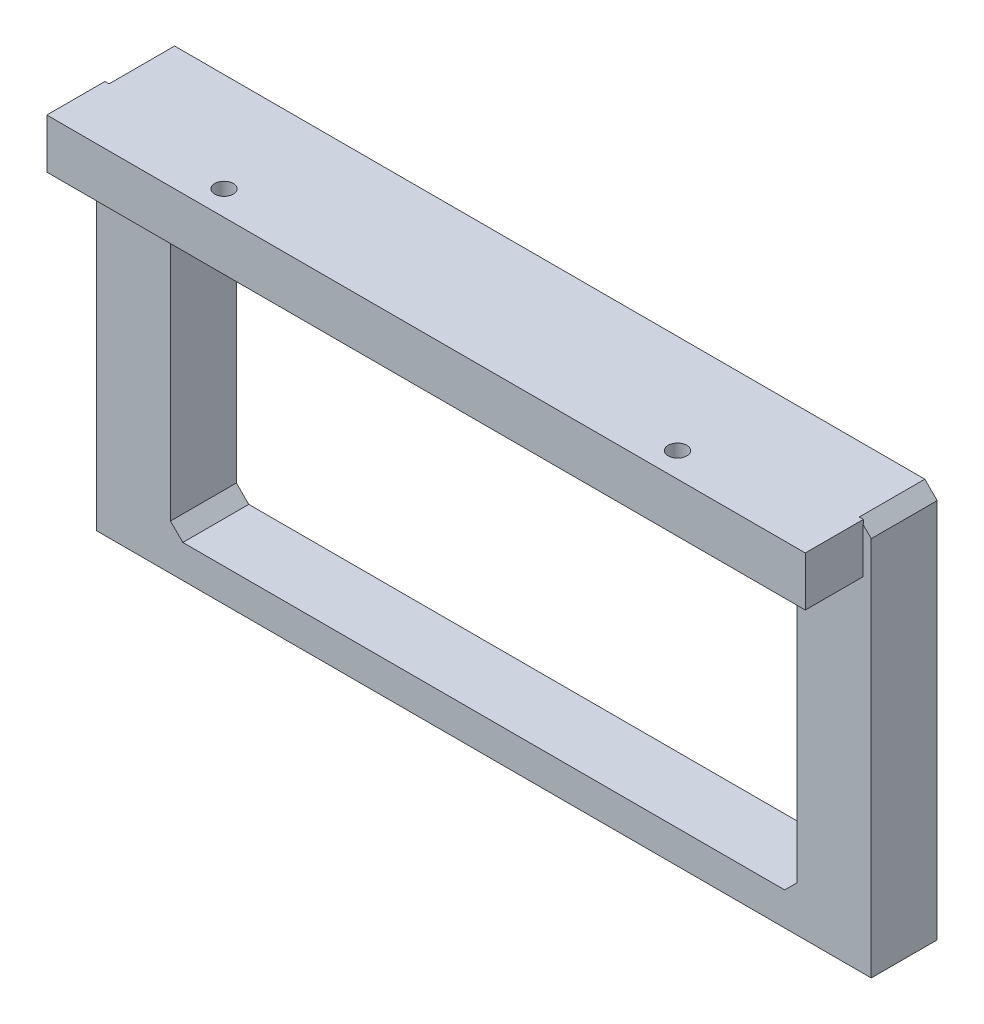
from build123d import *

# Parameters (mm, degrees)
FIXED_SIDE_FRAME_FLAT_PRINT_DEPTH              = 16
INWARD_LEDGE_TWO_VERTICAL_M4_THROUGH_HOL_START = 83.3
SKETCH_2_W                                     = 184
SKETCH_2_H                                     = 14.1
SKETCH_2_R                                     = 2.25
INWARD_LEDGE_TWO_VERTICAL_M4_THROUGH_HOL_DEPTH = 12


with BuildPart() as part:
    # Sketch 1 → Fixed_side_frame_flat_print (new body)
    with BuildSketch(Plane.XY):
        Polygon((-94, 0), (94, 0), (94, 92.3), (91, 95.3), (-91, 95.3), (-94, 92.3), align=None)
        Polygon((-73, 8), (73, 8), (76, 11), (76, 80.3), (73, 83.3), (-73, 83.3), (-76, 80.3), (-76, 11), align=None, mode=Mode.SUBTRACT)
    extrude(amount=FIXED_SIDE_FRAME_FLAT_PRINT_DEPTH)

    # Sketch 2 → Inward_ledge_two_vertical_M4_through_hol (add)
    with BuildSketch(Plane(origin=(0, 0, 0), x_dir=(1, 0, 0), z_dir=(0, 1, 0)).offset(INWARD_LEDGE_TWO_VERTICAL_M4_THROUGH_HOL_START)):
        with Locations((0, -22.95)):
            Rectangle(SKETCH_2_W, SKETCH_2_H)
        with Locations(Location((-55, -24, 0), (0, 0, 270))):
            Circle(SKETCH_2_R, mode=Mode.SUBTRACT)
        with Locations(Location((55, -24, 0), (0, 0, 270))):
            Circle(SKETCH_2_R, mode=Mode.SUBTRACT)
    extrude(amount=INWARD_LEDGE_TWO_VERTICAL_M4_THROUGH_HOL_DEPTH)


solid = part.part
